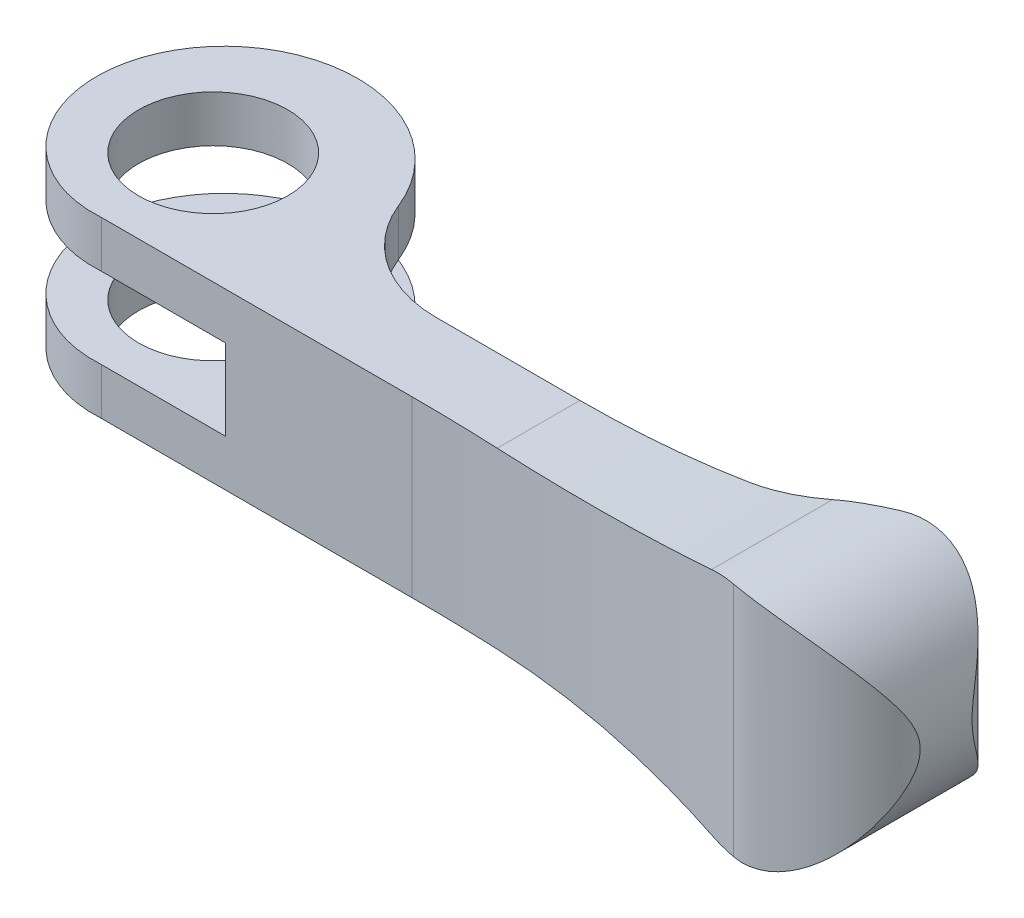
ISO-10303-21;
HEADER;
FILE_DESCRIPTION(('STEP AP214'),'2;1');
FILE_NAME('part.step','',(''),(''),'','','');
FILE_SCHEMA(('AUTOMOTIVE_DESIGN { 1 0 10303 214 1 1 1 1 }'));
ENDSEC;
DATA;
#1=APPLICATION_CONTEXT('core data for automotive mechanical design processes');
#2=APPLICATION_PROTOCOL_DEFINITION('international standard','automotive_design',2000,#1);
#3=PRODUCT_CONTEXT('',#1,'mechanical');
#4=PRODUCT('Part','Part','',(#3));
#5=PRODUCT_RELATED_PRODUCT_CATEGORY('part','',(#4));
#6=PRODUCT_DEFINITION_FORMATION('','',#4);
#7=PRODUCT_DEFINITION_CONTEXT('part definition',#1,'design');
#8=PRODUCT_DEFINITION('design','',#6,#7);
#9=PRODUCT_DEFINITION_SHAPE('','',#8);
#10=(LENGTH_UNIT() NAMED_UNIT(*) SI_UNIT(.MILLI.,.METRE.));
#11=(NAMED_UNIT(*) PLANE_ANGLE_UNIT() SI_UNIT($,.RADIAN.));
#12=(NAMED_UNIT(*) SI_UNIT($,.STERADIAN.) SOLID_ANGLE_UNIT());
#13=UNCERTAINTY_MEASURE_WITH_UNIT(LENGTH_MEASURE(1.E-05),#10,'distance_accuracy_value','');
#14=(GEOMETRIC_REPRESENTATION_CONTEXT(3) GLOBAL_UNCERTAINTY_ASSIGNED_CONTEXT((#13)) GLOBAL_UNIT_ASSIGNED_CONTEXT((#10,
#11,#12)) REPRESENTATION_CONTEXT('',''));
#15=CARTESIAN_POINT('',(0.,0.,0.));
#16=DIRECTION('',(0.,0.,1.));
#17=DIRECTION('',(1.,0.,0.));
#18=AXIS2_PLACEMENT_3D('',#15,#16,#17);
#19=CARTESIAN_POINT('',(25.0000000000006,-9.5,165.511363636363));
#20=DIRECTION('',(0.,1.,0.));
#21=DIRECTION('',(1.,0.,0.));
#22=AXIS2_PLACEMENT_3D('',#19,#20,#21);
#23=CYLINDRICAL_SURFACE('',#22,156.511363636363);
#24=CARTESIAN_POINT('',(51.3201707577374,9.24653148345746,11.2289746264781));
#25=CARTESIAN_POINT('',(51.4954696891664,9.2878649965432,11.2588777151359));
#26=CARTESIAN_POINT('',(51.6718456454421,9.32417702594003,11.2892762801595));
#27=CARTESIAN_POINT('',(52.0256660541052,9.38661054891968,11.3508882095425));
#28=CARTESIAN_POINT('',(52.2031054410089,9.41276355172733,11.3820987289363));
#29=CARTESIAN_POINT('',(52.7374701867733,9.47615348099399,11.4770445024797));
#30=CARTESIAN_POINT('',(53.0960294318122,9.49822441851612,11.5420236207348));
#31=CARTESIAN_POINT('',(53.4546518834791,9.49989176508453,11.6083430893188));
#32=B_SPLINE_CURVE_WITH_KNOTS('',3,(#24,#25,#26,#27,#28,#29,#30,#31),.UNSPECIFIED.,.F.,.F.,(4,2,
2,4),(0.,0.547600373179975,1.09348848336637,2.186546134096),.UNSPECIFIED.);
#33=CARTESIAN_POINT('',(51.3201707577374,9.24653148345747,11.2289746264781));
#34=VERTEX_POINT('',#33);
#35=CARTESIAN_POINT('',(53.4546518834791,9.49989176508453,11.6083430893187));
#36=VERTEX_POINT('',#35);
#37=EDGE_CURVE('E175',#34,#36,#32,.T.);
#38=ORIENTED_EDGE('',*,*,#37,.F.);
#39=CARTESIAN_POINT('',(32.,7.00000000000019,9.1566165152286));
#40=CARTESIAN_POINT('',(32.8182704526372,6.99999719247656,9.19324583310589));
#41=CARTESIAN_POINT('',(33.6361960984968,7.01192923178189,9.23630636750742));
#42=CARTESIAN_POINT('',(35.2705716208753,7.05957160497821,9.33520563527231));
#43=CARTESIAN_POINT('',(36.0870215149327,7.09528165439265,9.39104421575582));
#44=CARTESIAN_POINT('',(38.5259507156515,7.23753055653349,9.57706397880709));
#45=CARTESIAN_POINT('',(40.1451052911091,7.37919060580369,9.7260681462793));
#46=CARTESIAN_POINT('',(43.3672677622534,7.75507082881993,10.073027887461));
#47=CARTESIAN_POINT('',(44.9702760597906,7.98928869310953,10.2709822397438));
#48=CARTESIAN_POINT('',(47.3611114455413,8.40908803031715,10.6035220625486));
#49=CARTESIAN_POINT('',(48.1574841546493,8.56083603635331,10.7205953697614));
#50=CARTESIAN_POINT('',(49.7438041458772,8.88685979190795,10.9662394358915));
#51=CARTESIAN_POINT('',(50.5337515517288,9.061135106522,11.0948099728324));
#52=CARTESIAN_POINT('',(51.3201707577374,9.24653148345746,11.2289746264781));
#53=B_SPLINE_CURVE_WITH_KNOTS('',3,(#39,#40,#41,#42,#43,#44,#45,#46,#47,#48,#49,#50,#51,#52),
.UNSPECIFIED.,.F.,.F.,(4,2,2,2,2,2,4),(0.,2.45704528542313,4.9140611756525,9.8068264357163,
14.6994696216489,17.156439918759,19.6133627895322),.UNSPECIFIED.);
#54=CARTESIAN_POINT('',(32.,7.00000000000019,9.1566165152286));
#55=VERTEX_POINT('',#54);
#56=EDGE_CURVE('E143',#55,#34,#53,.T.);
#57=ORIENTED_EDGE('',*,*,#56,.F.);
#58=CARTESIAN_POINT('',(25.0000000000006,7.,165.511363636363));
#59=DIRECTION('',(0.,1.,0.));
#60=DIRECTION('',(1.,0.,0.));
#61=AXIS2_PLACEMENT_3D('',#58,#59,#60);
#62=CIRCLE('',#61,156.511363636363);
#63=CARTESIAN_POINT('',(25.,7.00000000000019,9.));
#64=VERTEX_POINT('',#63);
#65=EDGE_CURVE('E152',#64,#55,#62,.F.);
#66=ORIENTED_EDGE('',*,*,#65,.F.);
#67=DIRECTION('',(0.,1.,0.));
#68=VECTOR('',#67,1.);
#69=CARTESIAN_POINT('',(25.,-9.5000000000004,9.));
#70=LINE('',#69,#68);
#71=CARTESIAN_POINT('',(25.,-6.9999999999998,9.));
#72=VERTEX_POINT('',#71);
#73=EDGE_CURVE('E300',#72,#64,#70,.T.);
#74=ORIENTED_EDGE('',*,*,#73,.F.);
#75=CARTESIAN_POINT('',(25.0000000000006,-7.,165.511363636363));
#76=DIRECTION('',(0.,1.,0.));
#77=DIRECTION('',(1.,0.,0.));
#78=AXIS2_PLACEMENT_3D('',#75,#76,#77);
#79=CIRCLE('',#78,156.511363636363);
#80=CARTESIAN_POINT('',(32.,-6.9999999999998,9.1566165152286));
#81=VERTEX_POINT('',#80);
#82=EDGE_CURVE('E335',#72,#81,#79,.F.);
#83=ORIENTED_EDGE('',*,*,#82,.T.);
#84=CARTESIAN_POINT('',(32.,-6.9999999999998,9.1566165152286));
#85=CARTESIAN_POINT('',(32.8182704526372,-6.99999719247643,9.19324583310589));
#86=CARTESIAN_POINT('',(33.6361960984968,-7.01192923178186,9.23630636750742));
#87=CARTESIAN_POINT('',(35.2705716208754,-7.05957160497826,9.33520563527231));
#88=CARTESIAN_POINT('',(36.0870215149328,-7.09528165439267,9.39104421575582));
#89=CARTESIAN_POINT('',(38.5259507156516,-7.23753055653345,9.57706397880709));
#90=CARTESIAN_POINT('',(40.1451052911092,-7.37919060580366,9.7260681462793));
#91=CARTESIAN_POINT('',(43.3672677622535,-7.75507082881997,10.073027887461));
#92=CARTESIAN_POINT('',(44.9702760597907,-7.98928869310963,10.2709822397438));
#93=CARTESIAN_POINT('',(47.3611114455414,-8.40908803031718,10.6035220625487));
#94=CARTESIAN_POINT('',(48.1574841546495,-8.56083603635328,10.7205953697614));
#95=CARTESIAN_POINT('',(49.7438041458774,-8.88685979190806,10.9662394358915));
#96=CARTESIAN_POINT('',(50.533751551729,-9.06113510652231,11.0948099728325));
#97=CARTESIAN_POINT('',(51.3201707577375,-9.24653148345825,11.2289746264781));
#98=B_SPLINE_CURVE_WITH_KNOTS('',3,(#84,#85,#86,#87,#88,#89,#90,#91,#92,#93,#94,#95,#96,#97),
.UNSPECIFIED.,.F.,.F.,(4,2,2,2,2,2,4),(0.,2.45704528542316,4.91406117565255,9.80682643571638,
14.6994696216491,17.1564399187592,19.6133627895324),.UNSPECIFIED.);
#99=CARTESIAN_POINT('',(51.3201707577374,-9.24653148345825,11.2289746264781));
#100=VERTEX_POINT('',#99);
#101=EDGE_CURVE('E501',#81,#100,#98,.T.);
#102=ORIENTED_EDGE('',*,*,#101,.T.);
#103=CARTESIAN_POINT('',(51.3201707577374,-9.24653148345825,11.2289746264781));
#104=CARTESIAN_POINT('',(51.4954696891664,-9.28786499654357,11.2588777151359));
#105=CARTESIAN_POINT('',(51.6718456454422,-9.32417702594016,11.2892762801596));
#106=CARTESIAN_POINT('',(52.0256660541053,-9.38661054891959,11.3508882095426));
#107=CARTESIAN_POINT('',(52.203105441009,-9.41276355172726,11.3820987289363));
#108=CARTESIAN_POINT('',(52.7374701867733,-9.47615348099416,11.4770445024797));
#109=CARTESIAN_POINT('',(53.0960294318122,-9.49822441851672,11.5420236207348));
#110=CARTESIAN_POINT('',(53.4546518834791,-9.4998917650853,11.6083430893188));
#111=B_SPLINE_CURVE_WITH_KNOTS('',3,(#103,#104,#105,#106,#107,#108,#109,#110),.UNSPECIFIED.,.F.,
.F.,(4,2,2,4),(0.,0.547600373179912,1.0934884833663,2.18654613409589),.UNSPECIFIED.);
#112=CARTESIAN_POINT('',(53.4546518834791,-9.4998917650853,11.6083430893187));
#113=VERTEX_POINT('',#112);
#114=EDGE_CURVE('E220',#100,#113,#111,.T.);
#115=ORIENTED_EDGE('',*,*,#114,.T.);
#116=DIRECTION('',(0.,1.,0.));
#117=VECTOR('',#116,1.);
#118=CARTESIAN_POINT('',(53.4546518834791,-9.5000000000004,11.6083430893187));
#119=LINE('',#118,#117);
#120=EDGE_CURVE('E283',#113,#36,#119,.T.);
#121=ORIENTED_EDGE('',*,*,#120,.T.);
#122=EDGE_LOOP('',(#38,#57,#66,#74,#83,#102,#115,#121));
#123=FACE_BOUND('',#122,.T.);
#124=ADVANCED_FACE('F14',(#123),#23,.F.);
#125=CARTESIAN_POINT('',(0.,-9.5000000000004,9.));
#126=DIRECTION('',(0.,0.,-1.));
#127=DIRECTION('',(1.,0.,0.));
#128=AXIS2_PLACEMENT_3D('',#125,#126,#127);
#129=PLANE('',#128);
#130=DIRECTION('',(1.,0.,0.));
#131=VECTOR('',#130,1.);
#132=CARTESIAN_POINT('',(0.,7.00000000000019,9.));
#133=LINE('',#132,#131);
#134=CARTESIAN_POINT('',(0.,7.00000000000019,9.));
#135=VERTEX_POINT('',#134);
#136=EDGE_CURVE('E163',#135,#64,#133,.T.);
#137=ORIENTED_EDGE('',*,*,#136,.F.);
#138=DIRECTION('',(0.,1.,0.));
#139=VECTOR('',#138,1.);
#140=CARTESIAN_POINT('',(0.,-9.5000000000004,9.));
#141=LINE('',#140,#139);
#142=CARTESIAN_POINT('',(0.,3.25,9.));
#143=VERTEX_POINT('',#142);
#144=EDGE_CURVE('E291',#143,#135,#141,.T.);
#145=ORIENTED_EDGE('',*,*,#144,.F.);
#146=DIRECTION('',(1.,0.,0.));
#147=VECTOR('',#146,1.);
#148=CARTESIAN_POINT('',(0.,3.25,9.));
#149=LINE('',#148,#147);
#150=CARTESIAN_POINT('',(10.,3.25,9.));
#151=VERTEX_POINT('',#150);
#152=EDGE_CURVE('E345',#143,#151,#149,.T.);
#153=ORIENTED_EDGE('',*,*,#152,.T.);
#154=DIRECTION('',(0.,-1.,0.));
#155=VECTOR('',#154,1.);
#156=CARTESIAN_POINT('',(10.,-9.5000000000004,9.));
#157=LINE('',#156,#155);
#158=CARTESIAN_POINT('',(10.,-3.25,9.));
#159=VERTEX_POINT('',#158);
#160=EDGE_CURVE('E359',#151,#159,#157,.T.);
#161=ORIENTED_EDGE('',*,*,#160,.T.);
#162=DIRECTION('',(-1.,0.,0.));
#163=VECTOR('',#162,1.);
#164=CARTESIAN_POINT('',(0.,-3.25,9.));
#165=LINE('',#164,#163);
#166=CARTESIAN_POINT('',(0.,-3.25,9.));
#167=VERTEX_POINT('',#166);
#168=EDGE_CURVE('E354',#159,#167,#165,.T.);
#169=ORIENTED_EDGE('',*,*,#168,.T.);
#170=CARTESIAN_POINT('',(0.,-6.9999999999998,9.));
#171=VERTEX_POINT('',#170);
#172=EDGE_CURVE('E294',#171,#167,#141,.T.);
#173=ORIENTED_EDGE('',*,*,#172,.F.);
#174=DIRECTION('',(1.,0.,0.));
#175=VECTOR('',#174,1.);
#176=CARTESIAN_POINT('',(0.,-6.9999999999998,9.));
#177=LINE('',#176,#175);
#178=EDGE_CURVE('E502',#171,#72,#177,.T.);
#179=ORIENTED_EDGE('',*,*,#178,.T.);
#180=ORIENTED_EDGE('',*,*,#73,.T.);
#181=EDGE_LOOP('',(#137,#145,#153,#161,#169,#173,#179,#180));
#182=FACE_BOUND('',#181,.T.);
#183=ADVANCED_FACE('F271',(#182),#129,.F.);
#184=CARTESIAN_POINT('',(0.,-9.5000000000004,9.));
#185=CARTESIAN_POINT('',(-1.17809724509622,-9.5000000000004,9.082375));
#186=CARTESIAN_POINT('',(-2.38889185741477,-9.5000000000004,8.9303425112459));
#187=CARTESIAN_POINT('',(-4.68855121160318,-9.5000000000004,8.15611653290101));
#188=CARTESIAN_POINT('',(-5.77641227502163,-9.5000000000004,7.53398899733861));
#189=CARTESIAN_POINT('',(-7.650484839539,-9.5,5.89290811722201));
#190=CARTESIAN_POINT('',(-8.43577630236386,-9.5,4.87441779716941));
#191=CARTESIAN_POINT('',(-9.56393765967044,-9.5,2.58130784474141));
#192=CARTESIAN_POINT('',(-9.90612499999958,-9.5,1.3074915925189));
#193=CARTESIAN_POINT('',(-10.070875,-9.5,-1.307491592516));
#194=CARTESIAN_POINT('',(-9.8931145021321,-9.5,-2.64762964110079));
#195=CARTESIAN_POINT('',(-9.01985437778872,-9.5,-5.1863785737));
#196=CARTESIAN_POINT('',(-8.32445967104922,-9.5,-6.3838917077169));
#197=CARTESIAN_POINT('',(-6.50038754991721,-9.5,-8.4409555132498));
#198=CARTESIAN_POINT('',(-5.37224515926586,-9.5,-9.29951414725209));
#199=CARTESIAN_POINT('',(-2.84004562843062,-9.5,-10.5267096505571));
#200=CARTESIAN_POINT('',(-1.43688593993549,-9.5,-10.894625));
#201=CARTESIAN_POINT('',(1.43688593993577,-9.5,-11.059375));
#202=CARTESIAN_POINT('',(2.90636742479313,-9.5,-10.8558864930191));
#203=CARTESIAN_POINT('',(5.68420593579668,-9.5,-9.8835922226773));
#204=CARTESIAN_POINT('',(6.99137114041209,-9.5,-9.1149303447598));
#205=CARTESIAN_POINT('',(9.23142618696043,-9.5,-7.1078669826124));
#206=CARTESIAN_POINT('',(10.1632519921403,-9.5,-5.8700725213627));
#207=CARTESIAN_POINT('',(11.4894816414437,-9.5,-3.09878341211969));
#208=CARTESIAN_POINT('',(11.883125,-9.5,-1.5662802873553));
#209=CARTESIAN_POINT('',(12.047875,-9.5,1.5662802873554));
#210=CARTESIAN_POINT('',(11.8186584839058,-9.5,3.16510520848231));
#211=CARTESIAN_POINT('',(10.7473300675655,-9.5,6.18203329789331));
#212=CARTESIAN_POINT('',(9.90540101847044,-9.5000000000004,7.5988505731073));
#213=CARTESIAN_POINT('',(7.71534641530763,-9.5000000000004,10.021896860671));
#214=CARTESIAN_POINT('',(6.36789988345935,-9.5000000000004,11.0269898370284));
#215=CARTESIAN_POINT('',(3.35752119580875,-9.5000000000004,12.4522536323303));
#216=CARTESIAN_POINT('',(1.69567463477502,-9.5000000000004,12.871625));
#217=CARTESIAN_POINT('',(0.,-9.5000000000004,12.954));
#218=B_SPLINE_CURVE_WITH_KNOTS('',3,(#184,#185,#186,#187,#188,#189,#190,#191,#192,#193,#194,
#195,#196,#197,#198,#199,#200,#201,#202,#203,#204,#205,#206,#207,#208,#209,#210,#211,#212,#213,
#214,#215,#216,#217),.UNSPECIFIED.,.F.,.F.,(4,2,2,2,2,2,2,2,2,2,2,2,2,2,2,2,4),(0.,0.0625,0.125,
0.1875,0.25,0.3125,0.375,0.4375,0.5,0.5625,0.625,0.6875,0.75,0.8125,0.875,0.9375,1.),.UNSPECIFIED.);
#219=DIRECTION('',(0.,1.,0.));
#220=VECTOR('',#219,1.);
#221=SURFACE_OF_LINEAR_EXTRUSION('',#218,#220);
#222=CARTESIAN_POINT('',(0.,7.00000000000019,9.));
#223=CARTESIAN_POINT('',(-1.17809724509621,7.00000000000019,9.082375));
#224=CARTESIAN_POINT('',(-2.38889185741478,7.00000000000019,8.9303425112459));
#225=CARTESIAN_POINT('',(-4.68855121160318,7.0000000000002,8.15611653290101));
#226=CARTESIAN_POINT('',(-5.77641227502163,7.0000000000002,7.53398899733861));
#227=CARTESIAN_POINT('',(-7.650484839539,7.,5.89290811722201));
#228=CARTESIAN_POINT('',(-8.43577630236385,7.,4.87441779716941));
#229=CARTESIAN_POINT('',(-9.56393765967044,7.,2.58130784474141));
#230=CARTESIAN_POINT('',(-9.90612499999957,7.,1.30749159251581));
#231=CARTESIAN_POINT('',(-10.070875,7.,-1.307491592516));
#232=CARTESIAN_POINT('',(-9.89311450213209,7.0000000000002,-2.6476296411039));
#233=CARTESIAN_POINT('',(-9.01985437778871,7.0000000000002,-5.1863785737));
#234=CARTESIAN_POINT('',(-8.32445967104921,7.0000000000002,-6.3838917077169));
#235=CARTESIAN_POINT('',(-6.50038754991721,7.,-8.4409555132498));
#236=CARTESIAN_POINT('',(-5.37224515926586,7.,-9.29951414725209));
#237=CARTESIAN_POINT('',(-2.84004562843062,7.,-10.5267096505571));
#238=CARTESIAN_POINT('',(-1.43688593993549,7.,-10.894625));
#239=CARTESIAN_POINT('',(1.43688593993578,7.,-11.059375));
#240=CARTESIAN_POINT('',(2.90636742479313,7.,-10.8558864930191));
#241=CARTESIAN_POINT('',(5.68420593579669,7.,-9.8835922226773));
#242=CARTESIAN_POINT('',(6.99137114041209,7.,-9.1149303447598));
#243=CARTESIAN_POINT('',(9.23142618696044,7.00000000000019,-7.1078669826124));
#244=CARTESIAN_POINT('',(10.1632519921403,7.00000000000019,-5.8700725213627));
#245=CARTESIAN_POINT('',(11.4894816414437,7.00000000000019,-3.09878341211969));
#246=CARTESIAN_POINT('',(11.883125,7.00000000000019,-1.5662802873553));
#247=CARTESIAN_POINT('',(12.047875,7.,1.5662802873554));
#248=CARTESIAN_POINT('',(11.8186584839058,7.,3.16510520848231));
#249=CARTESIAN_POINT('',(10.7473300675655,7.,6.18203329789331));
#250=CARTESIAN_POINT('',(9.90540101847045,7.00000000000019,7.5988505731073));
#251=CARTESIAN_POINT('',(7.71534641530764,7.00000000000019,10.021896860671));
#252=CARTESIAN_POINT('',(6.36789988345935,7.00000000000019,11.0269898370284));
#253=CARTESIAN_POINT('',(3.35752119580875,7.00000000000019,12.4522536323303));
#254=CARTESIAN_POINT('',(1.69567463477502,7.00000000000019,12.871625));
#255=CARTESIAN_POINT('',(0.,7.00000000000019,12.954));
#256=B_SPLINE_CURVE_WITH_KNOTS('',3,(#222,#223,#224,#225,#226,#227,#228,#229,#230,#231,#232,
#233,#234,#235,#236,#237,#238,#239,#240,#241,#242,#243,#244,#245,#246,#247,#248,#249,#250,#251,
#252,#253,#254,#255),.UNSPECIFIED.,.F.,.F.,(4,2,2,2,2,2,2,2,2,2,2,2,2,2,2,2,4),(0.,0.0625,0.125,
0.1875,0.25,0.3125,0.375,0.4375,0.5,0.5625,0.625,0.6875,0.75,0.8125,0.875,0.9375,1.),.UNSPECIFIED.);
#257=CARTESIAN_POINT('',(11.1333903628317,7.00000000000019,-3.78460278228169));
#258=VERTEX_POINT('',#257);
#259=EDGE_CURVE('E161',#258,#135,#256,.F.);
#260=ORIENTED_EDGE('',*,*,#259,.F.);
#261=DIRECTION('',(0.,1.,0.));
#262=VECTOR('',#261,1.);
#263=CARTESIAN_POINT('',(11.1333903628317,9.5,-3.78460278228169));
#264=LINE('',#263,#262);
#265=CARTESIAN_POINT('',(11.1333903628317,3.2499999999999,-3.78460278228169));
#266=VERTEX_POINT('',#265);
#267=EDGE_CURVE('E35',#258,#266,#264,.F.);
#268=ORIENTED_EDGE('',*,*,#267,.T.);
#269=CARTESIAN_POINT('',(0.,3.25,9.));
#270=CARTESIAN_POINT('',(-1.17809724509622,3.25,9.082375));
#271=CARTESIAN_POINT('',(-2.38889185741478,3.25,8.9303425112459));
#272=CARTESIAN_POINT('',(-4.68855121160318,3.25,8.15611653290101));
#273=CARTESIAN_POINT('',(-5.77641227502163,3.25,7.53398899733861));
#274=CARTESIAN_POINT('',(-7.650484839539,3.25,5.89290811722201));
#275=CARTESIAN_POINT('',(-8.43577630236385,3.25,4.87441779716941));
#276=CARTESIAN_POINT('',(-9.56393765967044,3.2499999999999,2.58130784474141));
#277=CARTESIAN_POINT('',(-9.90612499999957,3.25,1.30749159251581));
#278=CARTESIAN_POINT('',(-10.070875,3.25,-1.307491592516));
#279=CARTESIAN_POINT('',(-9.89311450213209,3.25,-2.6476296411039));
#280=CARTESIAN_POINT('',(-9.01985437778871,3.25,-5.1863785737));
#281=CARTESIAN_POINT('',(-8.32445967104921,3.25,-6.3838917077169));
#282=CARTESIAN_POINT('',(-6.50038754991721,3.25,-8.4409555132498));
#283=CARTESIAN_POINT('',(-5.37224515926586,3.25,-9.29951414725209));
#284=CARTESIAN_POINT('',(-2.84004562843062,3.25,-10.5267096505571));
#285=CARTESIAN_POINT('',(-1.43688593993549,3.25,-10.894625));
#286=CARTESIAN_POINT('',(1.43688593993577,3.25,-11.059375));
#287=CARTESIAN_POINT('',(2.90636742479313,3.25,-10.8558864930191));
#288=CARTESIAN_POINT('',(5.68420593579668,3.25,-9.8835922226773));
#289=CARTESIAN_POINT('',(6.99137114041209,3.25,-9.1149303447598));
#290=CARTESIAN_POINT('',(9.23142618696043,3.25,-7.1078669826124));
#291=CARTESIAN_POINT('',(10.1632519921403,3.25,-5.8700725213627));
#292=CARTESIAN_POINT('',(11.4894816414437,3.25,-3.09878341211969));
#293=CARTESIAN_POINT('',(11.883125,3.25,-1.5662802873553));
#294=CARTESIAN_POINT('',(12.047875,3.25,1.5662802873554));
#295=CARTESIAN_POINT('',(11.8186584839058,3.2499999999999,3.16510520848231));
#296=CARTESIAN_POINT('',(10.7473300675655,3.25,6.18203329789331));
#297=CARTESIAN_POINT('',(9.90540101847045,3.25,7.5988505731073));
#298=CARTESIAN_POINT('',(7.71534641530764,3.2499999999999,10.021896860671));
#299=CARTESIAN_POINT('',(6.36789988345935,3.2499999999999,11.0269898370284));
#300=CARTESIAN_POINT('',(3.35752119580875,3.25,12.4522536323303));
#301=CARTESIAN_POINT('',(1.69567463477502,3.25,12.871625));
#302=CARTESIAN_POINT('',(0.,3.25,12.954));
#303=B_SPLINE_CURVE_WITH_KNOTS('',3,(#269,#270,#271,#272,#273,#274,#275,#276,#277,#278,#279,
#280,#281,#282,#283,#284,#285,#286,#287,#288,#289,#290,#291,#292,#293,#294,#295,#296,#297,#298,
#299,#300,#301,#302),.UNSPECIFIED.,.F.,.F.,(4,2,2,2,2,2,2,2,2,2,2,2,2,2,2,2,4),(0.,0.0625,0.125,
0.1875,0.25,0.3125,0.375,0.4375,0.5,0.5625,0.625,0.6875,0.75,0.8125,0.875,0.9375,1.),.UNSPECIFIED.);
#304=EDGE_CURVE('E39',#266,#143,#303,.F.);
#305=ORIENTED_EDGE('',*,*,#304,.T.);
#306=ORIENTED_EDGE('',*,*,#144,.T.);
#307=EDGE_LOOP('',(#260,#268,#305,#306));
#308=FACE_BOUND('',#307,.T.);
#309=ADVANCED_FACE('F277',(#308),#221,.F.);
#310=CARTESIAN_POINT('',(11.8345872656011,-9.5,2.5));
#311=DIRECTION('',(0.,0.,1.));
#312=DIRECTION('',(-1.,0.,0.));
#313=AXIS2_PLACEMENT_3D('',#310,#311,#312);
#314=PLANE('',#313);
#315=CARTESIAN_POINT('',(32.,91.2,2.5));
#316=DIRECTION('',(0.,0.,1.));
#317=DIRECTION('',(-1.,0.,0.));
#318=AXIS2_PLACEMENT_3D('',#315,#316,#317);
#319=CIRCLE('',#318,84.2);
#320=CARTESIAN_POINT('',(45.5626570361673,8.099492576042,2.5));
#321=VERTEX_POINT('',#320);
#322=CARTESIAN_POINT('',(32.,7.,2.5));
#323=VERTEX_POINT('',#322);
#324=EDGE_CURVE('E132',#321,#323,#319,.F.);
#325=ORIENTED_EDGE('',*,*,#324,.F.);
#326=DIRECTION('',(0.,1.,0.));
#327=VECTOR('',#326,1.);
#328=CARTESIAN_POINT('',(45.5626570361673,-9.5,2.5));
#329=LINE('',#328,#327);
#330=CARTESIAN_POINT('',(45.5626570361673,-8.099492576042,2.5));
#331=VERTEX_POINT('',#330);
#332=EDGE_CURVE('E287',#331,#321,#329,.T.);
#333=ORIENTED_EDGE('',*,*,#332,.F.);
#334=CARTESIAN_POINT('',(32.,-91.2,2.5));
#335=DIRECTION('',(0.,0.,1.));
#336=DIRECTION('',(-1.,0.,0.));
#337=AXIS2_PLACEMENT_3D('',#334,#335,#336);
#338=CIRCLE('',#337,84.2);
#339=CARTESIAN_POINT('',(32.,-7.,2.5));
#340=VERTEX_POINT('',#339);
#341=EDGE_CURVE('E255',#331,#340,#338,.T.);
#342=ORIENTED_EDGE('',*,*,#341,.T.);
#343=DIRECTION('',(-1.,0.,0.));
#344=VECTOR('',#343,1.);
#345=CARTESIAN_POINT('',(11.8345872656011,-7.,2.5));
#346=LINE('',#345,#344);
#347=CARTESIAN_POINT('',(20.417560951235,-7.,2.5));
#348=VERTEX_POINT('',#347);
#349=EDGE_CURVE('E318',#340,#348,#346,.T.);
#350=ORIENTED_EDGE('',*,*,#349,.T.);
#351=DIRECTION('',(0.,-1.,0.));
#352=VECTOR('',#351,1.);
#353=CARTESIAN_POINT('',(20.417560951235,9.5,2.5));
#354=LINE('',#353,#352);
#355=CARTESIAN_POINT('',(20.417560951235,-3.25,2.5));
#356=VERTEX_POINT('',#355);
#357=EDGE_CURVE('E303',#348,#356,#354,.F.);
#358=ORIENTED_EDGE('',*,*,#357,.T.);
#359=DIRECTION('',(-1.,0.,0.));
#360=VECTOR('',#359,1.);
#361=CARTESIAN_POINT('',(28.,-3.25,2.5));
#362=LINE('',#361,#360);
#363=CARTESIAN_POINT('',(10.,-3.25,2.5));
#364=VERTEX_POINT('',#363);
#365=EDGE_CURVE('E331',#356,#364,#362,.T.);
#366=ORIENTED_EDGE('',*,*,#365,.T.);
#367=DIRECTION('',(0.,1.,0.));
#368=VECTOR('',#367,1.);
#369=CARTESIAN_POINT('',(10.,-3.25,2.5));
#370=LINE('',#369,#368);
#371=CARTESIAN_POINT('',(10.,3.25,2.5));
#372=VERTEX_POINT('',#371);
#373=EDGE_CURVE('E329',#364,#372,#370,.T.);
#374=ORIENTED_EDGE('',*,*,#373,.T.);
#375=DIRECTION('',(-1.,0.,0.));
#376=VECTOR('',#375,1.);
#377=CARTESIAN_POINT('',(28.,3.25,2.5));
#378=LINE('',#377,#376);
#379=CARTESIAN_POINT('',(20.417560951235,3.25,2.5));
#380=VERTEX_POINT('',#379);
#381=EDGE_CURVE('E326',#380,#372,#378,.T.);
#382=ORIENTED_EDGE('',*,*,#381,.F.);
#383=CARTESIAN_POINT('',(20.417560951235,7.,2.5));
#384=VERTEX_POINT('',#383);
#385=EDGE_CURVE('E160',#380,#384,#354,.F.);
#386=ORIENTED_EDGE('',*,*,#385,.T.);
#387=DIRECTION('',(-1.,0.,0.));
#388=VECTOR('',#387,1.);
#389=CARTESIAN_POINT('',(11.8345872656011,7.,2.5));
#390=LINE('',#389,#388);
#391=EDGE_CURVE('E149',#323,#384,#390,.T.);
#392=ORIENTED_EDGE('',*,*,#391,.F.);
#393=EDGE_LOOP('',(#325,#333,#342,#350,#358,#366,#374,#382,#386,#392));
#394=FACE_BOUND('',#393,.T.);
#395=ADVANCED_FACE('F157',(#394),#314,.F.);
#396=CARTESIAN_POINT('',(45.5626570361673,-9.5,-14.5));
#397=DIRECTION('',(0.,1.,0.));
#398=DIRECTION('',(1.,0.,0.));
#399=AXIS2_PLACEMENT_3D('',#396,#397,#398);
#400=CYLINDRICAL_SURFACE('',#399,17.);
#401=CARTESIAN_POINT('',(54.9597606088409,9.38717736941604,-0.333333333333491));
#402=CARTESIAN_POINT('',(54.7316206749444,9.42267662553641,-0.181950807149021));
#403=CARTESIAN_POINT('',(54.498837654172,9.45033434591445,-0.0355271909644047));
#404=CARTESIAN_POINT('',(54.0250539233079,9.48845532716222,0.246646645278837));
#405=CARTESIAN_POINT('',(53.7840411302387,9.4988920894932,0.382380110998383));
#406=CARTESIAN_POINT('',(53.3000815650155,9.50092219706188,0.639552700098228));
#407=CARTESIAN_POINT('',(53.0572524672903,9.49285956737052,0.761209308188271));
#408=CARTESIAN_POINT('',(52.5674007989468,9.45729667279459,0.992150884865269));
#409=CARTESIAN_POINT('',(52.3203826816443,9.42981592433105,1.10144814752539));
#410=CARTESIAN_POINT('',(51.9475951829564,9.37315159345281,1.25597755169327));
#411=CARTESIAN_POINT('',(51.8226148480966,9.35161024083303,1.30604046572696));
#412=CARTESIAN_POINT('',(51.5718111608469,9.30314348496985,1.40308902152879));
#413=CARTESIAN_POINT('',(51.4459865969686,9.27619341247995,1.4500592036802));
#414=CARTESIAN_POINT('',(51.3201707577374,9.24653148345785,1.4953441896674));
#415=B_SPLINE_CURVE_WITH_KNOTS('',3,(#401,#402,#403,#404,#405,#406,#407,#408,#409,#410,#411,
#412,#413,#414),.UNSPECIFIED.,.F.,.F.,(4,2,2,2,2,2,4),(0.,0.828239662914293,1.65775258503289,
2.47196473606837,3.28535971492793,3.69427519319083,4.10509995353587),.UNSPECIFIED.);
#416=CARTESIAN_POINT('',(54.9597606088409,9.38717736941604,-0.333333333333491));
#417=VERTEX_POINT('',#416);
#418=CARTESIAN_POINT('',(51.3201707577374,9.24653148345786,1.4953441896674));
#419=VERTEX_POINT('',#418);
#420=EDGE_CURVE('E144',#417,#419,#415,.T.);
#421=ORIENTED_EDGE('',*,*,#420,.F.);
#422=DIRECTION('',(0.,1.,0.));
#423=VECTOR('',#422,1.);
#424=CARTESIAN_POINT('',(54.9597606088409,-9.5,-0.333333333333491));
#425=LINE('',#424,#423);
#426=CARTESIAN_POINT('',(54.9597606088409,-9.38717736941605,-0.333333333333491));
#427=VERTEX_POINT('',#426);
#428=EDGE_CURVE('E292',#427,#417,#425,.T.);
#429=ORIENTED_EDGE('',*,*,#428,.F.);
#430=CARTESIAN_POINT('',(54.9597606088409,-9.38717736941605,-0.333333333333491));
#431=CARTESIAN_POINT('',(54.7316206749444,-9.42267662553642,-0.181950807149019));
#432=CARTESIAN_POINT('',(54.498837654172,-9.45033434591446,-0.0355271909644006));
#433=CARTESIAN_POINT('',(54.0250539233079,-9.48845532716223,0.246646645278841));
#434=CARTESIAN_POINT('',(53.7840411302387,-9.4988920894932,0.382380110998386));
#435=CARTESIAN_POINT('',(53.3000815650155,-9.50092219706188,0.63955270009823));
#436=CARTESIAN_POINT('',(53.0572524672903,-9.49285956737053,0.761209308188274));
#437=CARTESIAN_POINT('',(52.5674007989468,-9.45729667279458,0.992150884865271));
#438=CARTESIAN_POINT('',(52.3203826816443,-9.42981592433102,1.1014481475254));
#439=CARTESIAN_POINT('',(51.9475951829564,-9.37315159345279,1.25597755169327));
#440=CARTESIAN_POINT('',(51.8226148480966,-9.35161024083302,1.30604046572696));
#441=CARTESIAN_POINT('',(51.5718111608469,-9.30314348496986,1.40308902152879));
#442=CARTESIAN_POINT('',(51.4459865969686,-9.27619341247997,1.4500592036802));
#443=CARTESIAN_POINT('',(51.3201707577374,-9.24653148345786,1.4953441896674));
#444=B_SPLINE_CURVE_WITH_KNOTS('',3,(#430,#431,#432,#433,#434,#435,#436,#437,#438,#439,#440,
#441,#442,#443),.UNSPECIFIED.,.F.,.F.,(4,2,2,2,2,2,4),(0.,0.828239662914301,1.65775258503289,
2.47196473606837,3.28535971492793,3.69427519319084,4.10509995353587),.UNSPECIFIED.);
#445=CARTESIAN_POINT('',(51.3201707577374,-9.24653148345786,1.4953441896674));
#446=VERTEX_POINT('',#445);
#447=EDGE_CURVE('E221',#427,#446,#444,.T.);
#448=ORIENTED_EDGE('',*,*,#447,.T.);
#449=CARTESIAN_POINT('',(51.3201707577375,-9.24653148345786,1.4953441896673));
#450=CARTESIAN_POINT('',(50.8603357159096,-9.13808848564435,1.66090351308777));
#451=CARTESIAN_POINT('',(50.3928479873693,-9.03200341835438,1.80673339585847));
#452=CARTESIAN_POINT('',(49.4492987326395,-8.82651076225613,2.05687636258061));
#453=CARTESIAN_POINT('',(48.9733251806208,-8.72705992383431,2.16148595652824));
#454=CARTESIAN_POINT('',(48.0126814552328,-8.53516921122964,2.32959170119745));
#455=CARTESIAN_POINT('',(47.5280109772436,-8.44272958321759,2.39308640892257));
#456=CARTESIAN_POINT('',(46.7955018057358,-8.30973871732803,2.45702873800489));
#457=CARTESIAN_POINT('',(46.5494786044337,-8.26620019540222,2.4731270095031));
#458=CARTESIAN_POINT('',(46.0565939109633,-8.18123846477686,2.49461289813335));
#459=CARTESIAN_POINT('',(45.8097323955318,-8.13981531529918,2.50000021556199));
#460=CARTESIAN_POINT('',(45.5626570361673,-8.099492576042,2.5));
#461=B_SPLINE_CURVE_WITH_KNOTS('',3,(#449,#450,#451,#452,#453,#454,#455,#456,#457,#458,#459,
#460),.UNSPECIFIED.,.F.,.F.,(4,2,2,2,2,4),(0.,1.50137798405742,2.99174983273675,
4.48217398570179,5.23305850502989,5.98396403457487),.UNSPECIFIED.);
#462=EDGE_CURVE('E289',#446,#331,#461,.T.);
#463=ORIENTED_EDGE('',*,*,#462,.T.);
#464=ORIENTED_EDGE('',*,*,#332,.T.);
#465=CARTESIAN_POINT('',(51.3201707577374,9.24653148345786,1.4953441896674));
#466=CARTESIAN_POINT('',(50.8603357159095,9.13808848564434,1.66090351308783));
#467=CARTESIAN_POINT('',(50.3928479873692,9.03200341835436,1.8067333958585));
#468=CARTESIAN_POINT('',(49.4492987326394,8.8265107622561,2.05687636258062));
#469=CARTESIAN_POINT('',(48.9733251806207,8.72705992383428,2.16148595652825));
#470=CARTESIAN_POINT('',(48.0126814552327,8.53516921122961,2.32959170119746));
#471=CARTESIAN_POINT('',(47.5280109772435,8.44272958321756,2.39308640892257));
#472=CARTESIAN_POINT('',(46.7955018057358,8.30973871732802,2.45702873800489));
#473=CARTESIAN_POINT('',(46.5494786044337,8.26620019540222,2.4731270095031));
#474=CARTESIAN_POINT('',(46.0565939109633,8.18123846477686,2.49461289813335));
#475=CARTESIAN_POINT('',(45.8097323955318,8.13981531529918,2.50000021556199));
#476=CARTESIAN_POINT('',(45.5626570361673,8.099492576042,2.5));
#477=B_SPLINE_CURVE_WITH_KNOTS('',3,(#465,#466,#467,#468,#469,#470,#471,#472,#473,#474,#475,
#476),.UNSPECIFIED.,.F.,.F.,(4,2,2,2,2,4),(0.,1.50137798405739,2.99174983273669,
4.48217398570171,5.23305850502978,5.98396403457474),.UNSPECIFIED.);
#478=EDGE_CURVE('E9',#419,#321,#477,.T.);
#479=ORIENTED_EDGE('',*,*,#478,.F.);
#480=EDGE_LOOP('',(#421,#429,#448,#463,#464,#479));
#481=FACE_BOUND('',#480,.T.);
#482=ADVANCED_FACE('F186',(#481),#400,.F.);
#483=CARTESIAN_POINT('',(58.,-9.5,4.25));
#484=DIRECTION('',(0.,1.,0.));
#485=DIRECTION('',(1.,0.,0.));
#486=AXIS2_PLACEMENT_3D('',#483,#484,#485);
#487=CYLINDRICAL_SURFACE('',#486,5.5);
#488=ORIENTED_EDGE('',*,*,#428,.T.);
#489=CARTESIAN_POINT('',(54.9597606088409,9.38717736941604,-0.333333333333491));
#490=CARTESIAN_POINT('',(55.0773672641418,9.36890920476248,-0.411379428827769));
#491=CARTESIAN_POINT('',(55.1977181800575,9.34791104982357,-0.484658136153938));
#492=CARTESIAN_POINT('',(55.4427584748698,9.30006282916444,-0.621356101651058));
#493=CARTESIAN_POINT('',(55.567447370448,9.27321341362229,-0.684776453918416));
#494=CARTESIAN_POINT('',(55.8194893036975,9.21339759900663,-0.801196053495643));
#495=CARTESIAN_POINT('',(55.9468283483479,9.1804583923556,-0.854239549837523));
#496=CARTESIAN_POINT('',(56.2035022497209,9.10817454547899,-0.950130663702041));
#497=CARTESIAN_POINT('',(56.3328370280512,9.0688301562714,-0.992978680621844));
#498=CARTESIAN_POINT('',(56.5923414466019,8.98365610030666,-1.06853033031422));
#499=CARTESIAN_POINT('',(56.7225111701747,8.93782577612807,-1.10123293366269));
#500=CARTESIAN_POINT('',(56.9825914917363,8.83973306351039,-1.1567151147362));
#501=CARTESIAN_POINT('',(57.1125019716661,8.78746822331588,-1.17949089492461));
#502=CARTESIAN_POINT('',(57.3709755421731,8.67671123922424,-1.21546938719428));
#503=CARTESIAN_POINT('',(57.49953864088,8.61821913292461,-1.2286721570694));
#504=CARTESIAN_POINT('',(57.7544514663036,8.49527400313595,-1.24600183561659));
#505=CARTESIAN_POINT('',(57.8808003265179,8.430818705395,-1.25012526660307));
#506=CARTESIAN_POINT('',(58.1354029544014,8.29365764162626,-1.24986389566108));
#507=CARTESIAN_POINT('',(58.2635348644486,8.22072656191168,-1.24513662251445));
#508=CARTESIAN_POINT('',(58.5158521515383,8.06925777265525,-1.22721754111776));
#509=CARTESIAN_POINT('',(58.6400360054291,7.99071793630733,-1.21402250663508));
#510=CARTESIAN_POINT('',(59.005866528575,7.7473260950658,-1.16283883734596));
#511=CARTESIAN_POINT('',(59.2408364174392,7.57467783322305,-1.11325109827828));
#512=CARTESIAN_POINT('',(59.640504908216,7.25224475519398,-1.00279535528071));
#513=CARTESIAN_POINT('',(59.8093120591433,7.10575174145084,-0.946787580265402));
#514=CARTESIAN_POINT('',(60.1338203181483,6.80378902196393,-0.82218057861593));
#515=CARTESIAN_POINT('',(60.2895153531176,6.64831521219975,-0.753575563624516));
#516=CARTESIAN_POINT('',(60.737174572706,6.16963779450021,-0.532140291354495));
#517=CARTESIAN_POINT('',(61.0091468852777,5.83464136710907,-0.363861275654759));
#518=CARTESIAN_POINT('',(61.4235163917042,5.24914542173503,-0.0596940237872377));
#519=CARTESIAN_POINT('',(61.5798678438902,5.00488750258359,0.0699222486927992));
#520=CARTESIAN_POINT('',(61.8685709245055,4.50557316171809,0.335588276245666));
#521=CARTESIAN_POINT('',(62.0009048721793,4.25050895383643,0.471642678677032));
#522=CARTESIAN_POINT('',(62.2419737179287,3.72966259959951,0.74447425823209));
#523=CARTESIAN_POINT('',(62.3506994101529,3.46387631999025,0.881251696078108));
#524=CARTESIAN_POINT('',(62.4960478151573,3.05644242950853,1.08102942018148));
#525=CARTESIAN_POINT('',(62.5415283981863,2.91921920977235,1.14670294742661));
#526=CARTESIAN_POINT('',(62.626527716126,2.64151248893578,1.27491345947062));
#527=CARTESIAN_POINT('',(62.6660477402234,2.50102970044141,1.33745112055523));
#528=CARTESIAN_POINT('',(62.7372492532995,2.22323842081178,1.45483334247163));
#529=CARTESIAN_POINT('',(62.7692149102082,2.08609863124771,1.50990265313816));
#530=CARTESIAN_POINT('',(62.8273897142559,1.8082943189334,1.61374359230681));
#531=CARTESIAN_POINT('',(62.8536014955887,1.66763144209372,1.66251809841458));
#532=CARTESIAN_POINT('',(62.8998518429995,1.38326816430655,1.75121136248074));
#533=CARTESIAN_POINT('',(62.9199198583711,1.23958589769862,1.79117210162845));
#534=CARTESIAN_POINT('',(62.95362517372,0.948860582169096,1.8597961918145));
#535=CARTESIAN_POINT('',(62.9672684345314,0.801820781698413,1.88847001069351));
#536=CARTESIAN_POINT('',(62.984943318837,0.545508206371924,1.9260711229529));
#537=CARTESIAN_POINT('',(62.990578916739,0.436822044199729,1.93824615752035));
#538=CARTESIAN_POINT('',(62.9981073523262,0.218764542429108,1.9545696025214));
#539=CARTESIAN_POINT('',(63.0000019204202,0.109393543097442,1.95872172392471));
#540=CARTESIAN_POINT('',(62.9999971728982,-0.161040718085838,1.95869806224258));
#541=CARTESIAN_POINT('',(62.9958843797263,-0.322130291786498,1.94966497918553));
#542=CARTESIAN_POINT('',(62.979631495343,-0.642129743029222,1.91470313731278));
#543=CARTESIAN_POINT('',(62.9674826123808,-0.801037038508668,1.88875587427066));
#544=CARTESIAN_POINT('',(62.9355349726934,-1.11623389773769,1.82269084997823));
#545=CARTESIAN_POINT('',(62.9156805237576,-1.272495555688,1.78247011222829));
#546=CARTESIAN_POINT('',(62.8688685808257,-1.58069825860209,1.69133860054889));
#547=CARTESIAN_POINT('',(62.8419105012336,-1.73263894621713,1.64042694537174));
#548=CARTESIAN_POINT('',(62.7611221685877,-2.13228410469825,1.49455458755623));
#549=CARTESIAN_POINT('',(62.7013579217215,-2.37630873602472,1.3928537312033));
#550=CARTESIAN_POINT('',(62.5643995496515,-2.8545711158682,1.17876211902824));
#551=CARTESIAN_POINT('',(62.4871914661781,-3.08880084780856,1.06636284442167));
#552=CARTESIAN_POINT('',(62.3155752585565,-3.54908261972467,0.837327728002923));
#553=CARTESIAN_POINT('',(62.221147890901,-3.77512516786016,0.720687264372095));
#554=CARTESIAN_POINT('',(62.0150908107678,-4.21937765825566,0.487922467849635));
#555=CARTESIAN_POINT('',(61.9034670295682,-4.43759026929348,0.371797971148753));
#556=CARTESIAN_POINT('',(61.6504966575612,-4.88801435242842,0.132083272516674));
#557=CARTESIAN_POINT('',(61.5072870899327,-5.11941519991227,0.00892283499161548));
#558=CARTESIAN_POINT('',(61.1989625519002,-5.57234434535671,-0.228224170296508));
#559=CARTESIAN_POINT('',(61.0338395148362,-5.79386896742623,-0.342207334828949));
#560=CARTESIAN_POINT('',(60.6818932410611,-6.22475035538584,-0.556218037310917));
#561=CARTESIAN_POINT('',(60.4951499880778,-6.43414792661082,-0.656294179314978));
#562=CARTESIAN_POINT('',(60.0994626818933,-6.83937860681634,-0.83818102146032));
#563=CARTESIAN_POINT('',(59.8905394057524,-7.03522413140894,-0.920008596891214));
#564=CARTESIAN_POINT('',(59.5457605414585,-7.32979660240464,-1.02995144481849));
#565=CARTESIAN_POINT('',(59.4171203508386,-7.43406962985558,-1.06603237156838));
#566=CARTESIAN_POINT('',(59.1532071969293,-7.63668086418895,-1.12945341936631));
#567=CARTESIAN_POINT('',(59.0179364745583,-7.73502105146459,-1.15679647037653));
#568=CARTESIAN_POINT('',(58.74132178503,-7.92506712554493,-1.20161088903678));
#569=CARTESIAN_POINT('',(58.599981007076,-8.01677642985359,-1.2190873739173));
#570=CARTESIAN_POINT('',(58.3119067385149,-8.19292687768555,-1.24305022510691));
#571=CARTESIAN_POINT('',(58.1651731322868,-8.27736786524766,-1.24953635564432));
#572=CARTESIAN_POINT('',(57.8658401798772,-8.4391150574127,-1.25042002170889));
#573=CARTESIAN_POINT('',(57.713196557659,-8.51634058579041,-1.24469479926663));
#574=CARTESIAN_POINT('',(57.4048258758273,-8.66206771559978,-1.2198898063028));
#575=CARTESIAN_POINT('',(57.2490986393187,-8.73056881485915,-1.20080926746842));
#576=CARTESIAN_POINT('',(56.9363620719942,-8.8583241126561,-1.1484970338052));
#577=CARTESIAN_POINT('',(56.7793539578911,-8.91758620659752,-1.11527751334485));
#578=CARTESIAN_POINT('',(56.4659305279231,-9.02667253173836,-1.03420803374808));
#579=CARTESIAN_POINT('',(56.3095150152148,-9.07650022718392,-0.986363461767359));
#580=CARTESIAN_POINT('',(55.947591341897,-9.18180315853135,-0.857411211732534));
#581=CARTESIAN_POINT('',(55.7430238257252,-9.23366184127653,-0.770533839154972));
#582=CARTESIAN_POINT('',(55.4433068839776,-9.29968394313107,-0.620921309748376));
#583=CARTESIAN_POINT('',(55.3445126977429,-9.31974185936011,-0.567783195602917));
#584=CARTESIAN_POINT('',(55.149828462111,-9.356167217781,-0.45522687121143));
#585=CARTESIAN_POINT('',(55.0539391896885,-9.37253368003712,-0.3958069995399));
#586=CARTESIAN_POINT('',(54.9597606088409,-9.38717736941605,-0.333333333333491));
#587=B_SPLINE_CURVE_WITH_KNOTS('',3,(#489,#490,#491,#492,#493,#494,#495,#496,#497,#498,#499,
#500,#501,#502,#503,#504,#505,#506,#507,#508,#509,#510,#511,#512,#513,#514,#515,#516,#517,#518,
#519,#520,#521,#522,#523,#524,#525,#526,#527,#528,#529,#530,#531,#532,#533,#534,#535,#536,#537,
#538,#539,#540,#541,#542,#543,#544,#545,#546,#547,#548,#549,#550,#551,#552,#553,#554,#555,#556,
#557,#558,#559,#560,#561,#562,#563,#564,#565,#566,#567,#568,#569,#570,#571,#572,#573,#574,#575,
#576,#577,#578,#579,#580,#581,#582,#583,#584,#585,#586),.UNSPECIFIED.,.F.,.F.,(4,2,2,2,2,2,2,2,
2,2,2,2,2,2,2,2,2,2,2,2,2,2,2,2,2,2,2,2,2,2,2,2,2,2,2,2,2,2,2,2,2,2,2,2,2,2,2,2,4),(0.,
0.426849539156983,0.853651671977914,1.27859214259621,1.70351596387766,2.12848288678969,
2.553612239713,2.97873902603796,3.40402862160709,3.84611534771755,4.28837060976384,
5.17273156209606,5.86310747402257,6.55380140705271,7.9374152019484,8.88939991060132,
9.84208261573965,10.7951361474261,11.2713458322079,11.7474523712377,12.2008264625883,
12.6539925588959,13.1049511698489,13.5554905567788,13.8836900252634,14.2117376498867,
14.6946640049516,15.1781195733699,15.6651364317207,16.1521934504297,16.9639239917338,
17.7763063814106,18.5896022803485,19.4026182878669,20.2977089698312,21.193130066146,
22.0853384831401,22.9767183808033,23.4847665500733,23.9926441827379,24.5002581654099,
25.0078830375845,25.5206349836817,26.033416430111,26.5457572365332,27.0579095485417,
27.7400838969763,28.0817283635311,28.4234634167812),.UNSPECIFIED.);
#588=EDGE_CURVE('E248',#417,#427,#587,.T.);
#589=ORIENTED_EDGE('',*,*,#588,.T.);
#590=EDGE_LOOP('',(#488,#589));
#591=FACE_BOUND('',#590,.T.);
#592=ADVANCED_FACE('F257',(#591),#487,.T.);
#593=CARTESIAN_POINT('',(55.,-9.5,3.25));
#594=DIRECTION('',(0.,1.,0.));
#595=DIRECTION('',(1.,0.,0.));
#596=AXIS2_PLACEMENT_3D('',#593,#594,#595);
#597=CYLINDRICAL_SURFACE('',#596,8.5);
#598=CARTESIAN_POINT('',(53.4546518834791,-9.4998917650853,11.6083430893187));
#599=CARTESIAN_POINT('',(53.6423117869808,-9.50083233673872,11.6430836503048));
#600=CARTESIAN_POINT('',(53.8311839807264,-9.49613015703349,11.6714242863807));
#601=CARTESIAN_POINT('',(54.2097225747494,-9.47533561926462,11.7153146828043));
#602=CARTESIAN_POINT('',(54.3993886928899,-9.45924701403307,11.7308686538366));
#603=CARTESIAN_POINT('',(54.7767770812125,-9.41571797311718,11.7491577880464));
#604=CARTESIAN_POINT('',(54.9645039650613,-9.38835217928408,11.75197580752));
#605=CARTESIAN_POINT('',(55.3377655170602,-9.322473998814,11.7453367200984));
#606=CARTESIAN_POINT('',(55.5233001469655,-9.28396141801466,11.7358793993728));
#607=CARTESIAN_POINT('',(55.8906023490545,-9.19622972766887,11.7052209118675));
#608=CARTESIAN_POINT('',(56.0723738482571,-9.14702246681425,11.6840327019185));
#609=CARTESIAN_POINT('',(56.4312552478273,-9.03841310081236,11.6305990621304));
#610=CARTESIAN_POINT('',(56.6083630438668,-8.97900648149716,11.598348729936));
#611=CARTESIAN_POINT('',(56.9570259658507,-8.85062243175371,11.523564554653));
#612=CARTESIAN_POINT('',(57.1285757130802,-8.7816360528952,11.4810210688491));
#613=CARTESIAN_POINT('',(57.4652138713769,-8.63486071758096,11.3865412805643));
#614=CARTESIAN_POINT('',(57.6303008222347,-8.55706978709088,11.3346028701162));
#615=CARTESIAN_POINT('',(58.0048776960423,-8.36737992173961,11.2043407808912));
#616=CARTESIAN_POINT('',(58.211781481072,-8.2525042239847,11.1228801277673));
#617=CARTESIAN_POINT('',(58.6125113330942,-8.01043741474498,10.9472524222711));
#618=CARTESIAN_POINT('',(58.8063337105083,-7.88324285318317,10.8530818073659));
#619=CARTESIAN_POINT('',(59.3682199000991,-7.4849734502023,10.5540193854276));
#620=CARTESIAN_POINT('',(59.716232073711,-7.19745676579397,10.3327483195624));
#621=CARTESIAN_POINT('',(60.2555156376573,-6.68610596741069,9.93606093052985));
#622=CARTESIAN_POINT('',(60.4614279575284,-6.47111454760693,9.76845367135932));
#623=CARTESIAN_POINT('',(60.8489233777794,-6.0274391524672,9.42311646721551));
#624=CARTESIAN_POINT('',(61.0304951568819,-5.79874887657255,9.24538186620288));
#625=CARTESIAN_POINT('',(61.3697759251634,-5.32921816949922,8.88360248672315));
#626=CARTESIAN_POINT('',(61.5274894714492,-5.08838007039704,8.6995589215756));
#627=CARTESIAN_POINT('',(61.819754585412,-4.59498771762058,8.32902484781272));
#628=CARTESIAN_POINT('',(61.9543159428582,-4.34243847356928,8.14253540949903));
#629=CARTESIAN_POINT('',(62.1448456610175,-3.94222451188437,7.8560830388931));
#630=CARTESIAN_POINT('',(62.2087823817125,-3.79893271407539,7.75523298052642));
#631=CARTESIAN_POINT('',(62.3298869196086,-3.50826094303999,7.55539100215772));
#632=CARTESIAN_POINT('',(62.3870556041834,-3.36088149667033,7.45639884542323));
#633=CARTESIAN_POINT('',(62.4945717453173,-3.06153263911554,7.2617011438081));
#634=CARTESIAN_POINT('',(62.5449197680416,-2.90956361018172,7.16599532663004));
#635=CARTESIAN_POINT('',(62.6386207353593,-2.60032339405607,6.97992501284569));
#636=CARTESIAN_POINT('',(62.6819753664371,-2.44305349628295,6.88955923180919));
#637=CARTESIAN_POINT('',(62.7761899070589,-2.06250037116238,6.68478151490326));
#638=CARTESIAN_POINT('',(62.8238351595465,-1.83643831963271,6.57394186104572));
#639=CARTESIAN_POINT('',(62.9036087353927,-1.37024963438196,6.37954619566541));
#640=CARTESIAN_POINT('',(62.9357849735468,-1.13016904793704,6.29590619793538));
#641=CARTESIAN_POINT('',(62.9722836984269,-0.739461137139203,6.19859393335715));
#642=CARTESIAN_POINT('',(62.9826244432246,-0.593107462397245,6.17028973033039));
#643=CARTESIAN_POINT('',(62.9964757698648,-0.297822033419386,6.13215426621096));
#644=CARTESIAN_POINT('',(62.999997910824,-0.148895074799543,6.12229174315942));
#645=CARTESIAN_POINT('',(63.0000017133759,0.122111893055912,6.1222727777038));
#646=CARTESIAN_POINT('',(62.9976358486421,0.244202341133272,6.12889073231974));
#647=CARTESIAN_POINT('',(62.988293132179,0.486893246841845,6.15471321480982));
#648=CARTESIAN_POINT('',(62.9813136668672,0.607492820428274,6.17392487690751));
#649=CARTESIAN_POINT('',(62.95376679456,0.96642324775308,6.24839757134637));
#650=CARTESIAN_POINT('',(62.9265947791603,1.20077401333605,6.32047358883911));
#651=CARTESIAN_POINT('',(62.863834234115,1.61373086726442,6.47735658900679));
#652=CARTESIAN_POINT('',(62.8306975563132,1.79468733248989,6.55741650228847));
#653=CARTESIAN_POINT('',(62.7555559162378,2.14881133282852,6.72997642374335));
#654=CARTESIAN_POINT('',(62.7135429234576,2.32197164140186,6.82248766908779));
#655=CARTESIAN_POINT('',(62.6211333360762,2.66196724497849,7.0156118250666));
#656=CARTESIAN_POINT('',(62.5707136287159,2.82878350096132,7.11624666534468));
#657=CARTESIAN_POINT('',(62.4618554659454,3.15673668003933,7.32238460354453));
#658=CARTESIAN_POINT('',(62.4034146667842,3.31787192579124,7.42788911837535));
#659=CARTESIAN_POINT('',(62.2830866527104,3.62387275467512,7.63404729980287));
#660=CARTESIAN_POINT('',(62.2217407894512,3.76908003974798,7.73451175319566));
#661=CARTESIAN_POINT('',(62.0922523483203,4.05560152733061,7.93661688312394));
#662=CARTESIAN_POINT('',(62.0241089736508,4.19691527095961,8.03825769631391));
#663=CARTESIAN_POINT('',(61.8093425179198,4.61555558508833,8.34359610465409));
#664=CARTESIAN_POINT('',(61.6524311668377,4.88745936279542,8.54762552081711));
#665=CARTESIAN_POINT('',(61.310925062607,5.41648447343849,8.95016493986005));
#666=CARTESIAN_POINT('',(61.1263878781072,5.67363504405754,9.14868542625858));
#667=CARTESIAN_POINT('',(60.7285122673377,6.17254331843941,9.53578594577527));
#668=CARTESIAN_POINT('',(60.5151934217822,6.41431132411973,9.72437261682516));
#669=CARTESIAN_POINT('',(60.1344519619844,6.80305791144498,10.0268287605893));
#670=CARTESIAN_POINT('',(59.9752105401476,6.95492247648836,10.144767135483));
#671=CARTESIAN_POINT('',(59.6432222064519,7.24983570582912,10.3725703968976));
#672=CARTESIAN_POINT('',(59.4704732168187,7.39288300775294,10.4824340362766));
#673=CARTESIAN_POINT('',(59.1117063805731,7.66876085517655,10.6922446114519));
#674=CARTESIAN_POINT('',(58.9257051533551,7.80160377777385,10.7922036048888));
#675=CARTESIAN_POINT('',(58.5404851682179,8.05585062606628,10.9805172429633));
#676=CARTESIAN_POINT('',(58.3412700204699,8.17725765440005,11.068875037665));
#677=CARTESIAN_POINT('',(57.968876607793,8.38544531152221,11.2166809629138));
#678=CARTESIAN_POINT('',(57.7978525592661,8.47444286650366,11.2784404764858));
#679=CARTESIAN_POINT('',(57.448004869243,8.64297035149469,11.3919330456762));
#680=CARTESIAN_POINT('',(57.2691829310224,8.722502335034,11.4436682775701));
#681=CARTESIAN_POINT('',(56.9047204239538,8.87110760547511,11.5359716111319));
#682=CARTESIAN_POINT('',(56.7190892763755,8.94019471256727,11.5765545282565));
#683=CARTESIAN_POINT('',(56.3419020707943,9.06714778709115,11.6455964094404));
#684=CARTESIAN_POINT('',(56.1503485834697,9.12501854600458,11.6740605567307));
#685=CARTESIAN_POINT('',(55.7541140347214,9.23107910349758,11.7189288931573));
#686=CARTESIAN_POINT('',(55.5492241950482,9.2787390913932,11.7347554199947));
#687=CARTESIAN_POINT('',(55.1361397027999,9.36041574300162,11.7514235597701));
#688=CARTESIAN_POINT('',(54.9279450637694,9.39443246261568,11.7522652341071));
#689=CARTESIAN_POINT('',(54.5082659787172,9.44873284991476,11.7383835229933));
#690=CARTESIAN_POINT('',(54.2967689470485,9.4688857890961,11.7235152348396));
#691=CARTESIAN_POINT('',(53.9801800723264,9.48844796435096,11.6892695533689));
#692=CARTESIAN_POINT('',(53.8747162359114,9.49319056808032,11.6758557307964));
#693=CARTESIAN_POINT('',(53.6642670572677,9.49916307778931,11.6450656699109));
#694=CARTESIAN_POINT('',(53.5592817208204,9.5003929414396,11.627689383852));
#695=CARTESIAN_POINT('',(53.4546518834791,9.49989176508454,11.6083430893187));
#696=B_SPLINE_CURVE_WITH_KNOTS('',3,(#598,#599,#600,#601,#602,#603,#604,#605,#606,#607,#608,
#609,#610,#611,#612,#613,#614,#615,#616,#617,#618,#619,#620,#621,#622,#623,#624,#625,#626,#627,
#628,#629,#630,#631,#632,#633,#634,#635,#636,#637,#638,#639,#640,#641,#642,#643,#644,#645,#646,
#647,#648,#649,#650,#651,#652,#653,#654,#655,#656,#657,#658,#659,#660,#661,#662,#663,#664,#665,
#666,#667,#668,#669,#670,#671,#672,#673,#674,#675,#676,#677,#678,#679,#680,#681,#682,#683,#684,
#685,#686,#687,#688,#689,#690,#691,#692,#693,#694,#695),.UNSPECIFIED.,.F.,.F.,(4,2,2,2,2,2,2,2,
2,2,2,2,2,2,2,2,2,2,2,2,2,2,2,2,2,2,2,2,2,2,2,2,2,2,2,2,2,2,2,2,2,2,2,2,2,2,2,2,4),(0.,
0.572361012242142,1.14453346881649,1.71297813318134,2.28143269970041,2.84926065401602,
3.41734057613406,3.98595475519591,4.55469667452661,5.30441138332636,6.05433667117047,
7.55583802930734,8.57962374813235,9.60388401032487,10.6279483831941,11.6515786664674,
12.2110073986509,12.7703643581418,13.3296748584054,13.8888502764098,14.6561977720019,
15.4211528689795,15.868311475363,16.3147113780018,16.6808130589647,17.0471223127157,
17.7830108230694,18.3841649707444,18.9858653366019,19.5892481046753,20.1928075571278,
20.753408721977,21.3140756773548,22.4358752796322,23.5553689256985,24.6741047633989,
25.4225223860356,26.1710553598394,26.9186655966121,27.6660724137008,28.2728430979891,
28.8794819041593,29.48531087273,30.0908804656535,30.7227587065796,31.3546343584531,
31.9923894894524,32.3115322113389,32.6306787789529),.UNSPECIFIED.);
#697=EDGE_CURVE('E210',#113,#36,#696,.T.);
#698=ORIENTED_EDGE('',*,*,#697,.T.);
#699=ORIENTED_EDGE('',*,*,#120,.F.);
#700=EDGE_LOOP('',(#698,#699));
#701=FACE_BOUND('',#700,.T.);
#702=ADVANCED_FACE('F227',(#701),#597,.T.);
#703=CARTESIAN_POINT('',(20.4175609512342,0.,-7.5));
#704=DIRECTION('',(0.,1.,0.));
#705=DIRECTION('',(1.,0.,0.));
#706=AXIS2_PLACEMENT_3D('',#703,#704,#705);
#707=CYLINDRICAL_SURFACE('',#706,10.);
#708=CARTESIAN_POINT('',(20.4175609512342,7.,-7.5));
#709=DIRECTION('',(0.,1.,0.));
#710=DIRECTION('',(1.,0.,0.));
#711=AXIS2_PLACEMENT_3D('',#708,#709,#710);
#712=CIRCLE('',#711,10.);
#713=EDGE_CURVE('E28',#384,#258,#712,.F.);
#714=ORIENTED_EDGE('',*,*,#713,.F.);
#715=ORIENTED_EDGE('',*,*,#385,.F.);
#716=CARTESIAN_POINT('',(20.4175609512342,3.25,-7.5));
#717=DIRECTION('',(0.,1.,0.));
#718=DIRECTION('',(1.,0.,0.));
#719=AXIS2_PLACEMENT_3D('',#716,#717,#718);
#720=CIRCLE('',#719,10.);
#721=EDGE_CURVE('E307',#380,#266,#720,.F.);
#722=ORIENTED_EDGE('',*,*,#721,.T.);
#723=ORIENTED_EDGE('',*,*,#267,.F.);
#724=EDGE_LOOP('',(#714,#715,#722,#723));
#725=FACE_BOUND('',#724,.T.);
#726=ADVANCED_FACE('F237',(#725),#707,.F.);
#727=CARTESIAN_POINT('',(11.1333903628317,-3.2500000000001,-3.78460278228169));
#728=VERTEX_POINT('',#727);
#729=CARTESIAN_POINT('',(11.1333903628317,-6.9999999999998,-3.78460278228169));
#730=VERTEX_POINT('',#729);
#731=EDGE_CURVE('E305',#728,#730,#264,.F.);
#732=ORIENTED_EDGE('',*,*,#731,.T.);
#733=CARTESIAN_POINT('',(0.,-6.9999999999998,9.));
#734=CARTESIAN_POINT('',(-1.17809724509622,-6.9999999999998,9.082375));
#735=CARTESIAN_POINT('',(-2.38889185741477,-6.9999999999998,8.9303425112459));
#736=CARTESIAN_POINT('',(-4.68855121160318,-6.9999999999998,8.15611653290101));
#737=CARTESIAN_POINT('',(-5.77641227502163,-6.9999999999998,7.53398899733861));
#738=CARTESIAN_POINT('',(-7.650484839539,-7.,5.89290811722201));
#739=CARTESIAN_POINT('',(-8.43577630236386,-7.,4.87441779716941));
#740=CARTESIAN_POINT('',(-9.56393765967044,-7.,2.58130784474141));
#741=CARTESIAN_POINT('',(-9.90612499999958,-7.,1.3074915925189));
#742=CARTESIAN_POINT('',(-10.070875,-7.,-1.307491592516));
#743=CARTESIAN_POINT('',(-9.8931145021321,-6.9999999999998,-2.64762964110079));
#744=CARTESIAN_POINT('',(-9.01985437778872,-6.9999999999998,-5.1863785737));
#745=CARTESIAN_POINT('',(-8.32445967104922,-6.9999999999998,-6.3838917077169));
#746=CARTESIAN_POINT('',(-6.50038754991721,-7.,-8.4409555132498));
#747=CARTESIAN_POINT('',(-5.37224515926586,-7.,-9.29951414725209));
#748=CARTESIAN_POINT('',(-2.84004562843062,-7.,-10.5267096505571));
#749=CARTESIAN_POINT('',(-1.43688593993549,-7.,-10.894625));
#750=CARTESIAN_POINT('',(1.43688593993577,-7.,-11.059375));
#751=CARTESIAN_POINT('',(2.90636742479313,-7.,-10.8558864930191));
#752=CARTESIAN_POINT('',(5.68420593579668,-7.,-9.8835922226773));
#753=CARTESIAN_POINT('',(6.99137114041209,-7.,-9.1149303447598));
#754=CARTESIAN_POINT('',(9.23142618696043,-6.9999999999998,-7.1078669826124));
#755=CARTESIAN_POINT('',(10.1632519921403,-6.9999999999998,-5.8700725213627));
#756=CARTESIAN_POINT('',(11.4894816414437,-6.9999999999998,-3.09878341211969));
#757=CARTESIAN_POINT('',(11.883125,-6.9999999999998,-1.5662802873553));
#758=CARTESIAN_POINT('',(12.047875,-7.,1.5662802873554));
#759=CARTESIAN_POINT('',(11.8186584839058,-7.,3.16510520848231));
#760=CARTESIAN_POINT('',(10.7473300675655,-7.,6.18203329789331));
#761=CARTESIAN_POINT('',(9.90540101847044,-6.9999999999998,7.5988505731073));
#762=CARTESIAN_POINT('',(7.71534641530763,-6.9999999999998,10.021896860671));
#763=CARTESIAN_POINT('',(6.36789988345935,-6.9999999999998,11.0269898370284));
#764=CARTESIAN_POINT('',(3.35752119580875,-6.9999999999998,12.4522536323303));
#765=CARTESIAN_POINT('',(1.69567463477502,-6.9999999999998,12.871625));
#766=CARTESIAN_POINT('',(0.,-6.9999999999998,12.954));
#767=B_SPLINE_CURVE_WITH_KNOTS('',3,(#733,#734,#735,#736,#737,#738,#739,#740,#741,#742,#743,
#744,#745,#746,#747,#748,#749,#750,#751,#752,#753,#754,#755,#756,#757,#758,#759,#760,#761,#762,
#763,#764,#765,#766),.UNSPECIFIED.,.F.,.F.,(4,2,2,2,2,2,2,2,2,2,2,2,2,2,2,2,4),(0.,0.0625,0.125,
0.1875,0.25,0.3125,0.375,0.4375,0.5,0.5625,0.625,0.6875,0.75,0.8125,0.875,0.9375,1.),.UNSPECIFIED.);
#768=EDGE_CURVE('E504',#730,#171,#767,.F.);
#769=ORIENTED_EDGE('',*,*,#768,.T.);
#770=ORIENTED_EDGE('',*,*,#172,.T.);
#771=CARTESIAN_POINT('',(0.,-3.25,9.));
#772=CARTESIAN_POINT('',(-1.17809724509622,-3.25,9.082375));
#773=CARTESIAN_POINT('',(-2.38889185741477,-3.25,8.9303425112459));
#774=CARTESIAN_POINT('',(-4.68855121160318,-3.25,8.15611653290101));
#775=CARTESIAN_POINT('',(-5.77641227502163,-3.25,7.53398899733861));
#776=CARTESIAN_POINT('',(-7.650484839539,-3.25,5.89290811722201));
#777=CARTESIAN_POINT('',(-8.43577630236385,-3.25,4.87441779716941));
#778=CARTESIAN_POINT('',(-9.56393765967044,-3.2500000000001,2.58130784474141));
#779=CARTESIAN_POINT('',(-9.90612499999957,-3.25,1.3074915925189));
#780=CARTESIAN_POINT('',(-10.070875,-3.25,-1.307491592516));
#781=CARTESIAN_POINT('',(-9.89311450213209,-3.25,-2.6476296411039));
#782=CARTESIAN_POINT('',(-9.01985437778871,-3.25,-5.1863785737));
#783=CARTESIAN_POINT('',(-8.32445967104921,-3.25,-6.3838917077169));
#784=CARTESIAN_POINT('',(-6.50038754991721,-3.25,-8.4409555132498));
#785=CARTESIAN_POINT('',(-5.37224515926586,-3.25,-9.29951414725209));
#786=CARTESIAN_POINT('',(-2.84004562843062,-3.25,-10.5267096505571));
#787=CARTESIAN_POINT('',(-1.43688593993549,-3.25,-10.894625));
#788=CARTESIAN_POINT('',(1.43688593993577,-3.25,-11.059375));
#789=CARTESIAN_POINT('',(2.90636742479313,-3.25,-10.8558864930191));
#790=CARTESIAN_POINT('',(5.68420593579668,-3.25,-9.8835922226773));
#791=CARTESIAN_POINT('',(6.99137114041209,-3.25,-9.1149303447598));
#792=CARTESIAN_POINT('',(9.23142618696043,-3.25,-7.1078669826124));
#793=CARTESIAN_POINT('',(10.1632519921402,-3.25,-5.8700725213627));
#794=CARTESIAN_POINT('',(11.4894816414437,-3.25,-3.09878341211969));
#795=CARTESIAN_POINT('',(11.883125,-3.25,-1.5662802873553));
#796=CARTESIAN_POINT('',(12.047875,-3.25,1.5662802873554));
#797=CARTESIAN_POINT('',(11.8186584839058,-3.2500000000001,3.16510520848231));
#798=CARTESIAN_POINT('',(10.7473300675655,-3.25,6.18203329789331));
#799=CARTESIAN_POINT('',(9.90540101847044,-3.25,7.5988505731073));
#800=CARTESIAN_POINT('',(7.71534641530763,-3.2500000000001,10.021896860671));
#801=CARTESIAN_POINT('',(6.36789988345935,-3.2500000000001,11.0269898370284));
#802=CARTESIAN_POINT('',(3.35752119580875,-3.25,12.4522536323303));
#803=CARTESIAN_POINT('',(1.69567463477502,-3.25,12.871625));
#804=CARTESIAN_POINT('',(0.,-3.25,12.954));
#805=B_SPLINE_CURVE_WITH_KNOTS('',3,(#771,#772,#773,#774,#775,#776,#777,#778,#779,#780,#781,
#782,#783,#784,#785,#786,#787,#788,#789,#790,#791,#792,#793,#794,#795,#796,#797,#798,#799,#800,
#801,#802,#803,#804),.UNSPECIFIED.,.F.,.F.,(4,2,2,2,2,2,2,2,2,2,2,2,2,2,2,2,4),(0.,0.0625,0.125,
0.1875,0.25,0.3125,0.375,0.4375,0.5,0.5625,0.625,0.6875,0.75,0.8125,0.875,0.9375,1.),.UNSPECIFIED.);
#806=EDGE_CURVE('E350',#167,#728,#805,.T.);
#807=ORIENTED_EDGE('',*,*,#806,.T.);
#808=EDGE_LOOP('',(#732,#769,#770,#807));
#809=FACE_BOUND('',#808,.T.);
#810=ADVANCED_FACE('F370',(#809),#221,.F.);
#811=ORIENTED_EDGE('',*,*,#357,.F.);
#812=CARTESIAN_POINT('',(20.4175609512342,-7.,-7.5));
#813=DIRECTION('',(0.,1.,0.));
#814=DIRECTION('',(1.,0.,0.));
#815=AXIS2_PLACEMENT_3D('',#812,#813,#814);
#816=CIRCLE('',#815,10.);
#817=EDGE_CURVE('E511',#348,#730,#816,.F.);
#818=ORIENTED_EDGE('',*,*,#817,.T.);
#819=ORIENTED_EDGE('',*,*,#731,.F.);
#820=CARTESIAN_POINT('',(20.4175609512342,-3.25,-7.5));
#821=DIRECTION('',(0.,-1.,0.));
#822=DIRECTION('',(-1.,0.,0.));
#823=AXIS2_PLACEMENT_3D('',#820,#821,#822);
#824=CIRCLE('',#823,10.);
#825=EDGE_CURVE('E310',#728,#356,#824,.F.);
#826=ORIENTED_EDGE('',*,*,#825,.T.);
#827=EDGE_LOOP('',(#811,#818,#819,#826));
#828=FACE_BOUND('',#827,.T.);
#829=ADVANCED_FACE('F488',(#828),#707,.F.);
#830=CARTESIAN_POINT('',(10.0000000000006,-3.25,50.));
#831=DIRECTION('',(1.,0.,0.));
#832=DIRECTION('',(0.,0.,1.));
#833=AXIS2_PLACEMENT_3D('',#830,#831,#832);
#834=PLANE('',#833);
#835=DIRECTION('',(0.,0.,-1.));
#836=VECTOR('',#835,1.);
#837=CARTESIAN_POINT('',(10.0000000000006,3.25,50.));
#838=LINE('',#837,#836);
#839=EDGE_CURVE('E333',#151,#372,#838,.T.);
#840=ORIENTED_EDGE('',*,*,#839,.T.);
#841=ORIENTED_EDGE('',*,*,#373,.F.);
#842=DIRECTION('',(0.,0.,-1.));
#843=VECTOR('',#842,1.);
#844=CARTESIAN_POINT('',(10.0000000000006,-3.25,50.));
#845=LINE('',#844,#843);
#846=EDGE_CURVE('E338',#159,#364,#845,.T.);
#847=ORIENTED_EDGE('',*,*,#846,.F.);
#848=ORIENTED_EDGE('',*,*,#160,.F.);
#849=EDGE_LOOP('',(#840,#841,#847,#848));
#850=FACE_BOUND('',#849,.T.);
#851=ADVANCED_FACE('F485',(#850),#834,.F.);
#852=CARTESIAN_POINT('',(10.0000000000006,-3.25,50.));
#853=DIRECTION('',(0.,-1.,0.));
#854=DIRECTION('',(-1.,0.,0.));
#855=AXIS2_PLACEMENT_3D('',#852,#853,#854);
#856=PLANE('',#855);
#857=CARTESIAN_POINT('',(0.,-3.25,0.));
#858=DIRECTION('',(0.,-1.,0.));
#859=DIRECTION('',(0.,0.,-1.));
#860=AXIS2_PLACEMENT_3D('',#857,#858,#859);
#861=CIRCLE('',#860,6.);
#862=CARTESIAN_POINT('',(0.,-3.25,-6.));
#863=VERTEX_POINT('',#862);
#864=EDGE_CURVE('E154',#863,#863,#861,.T.);
#865=ORIENTED_EDGE('',*,*,#864,.T.);
#866=EDGE_LOOP('',(#865));
#867=FACE_BOUND('',#866,.T.);
#868=ORIENTED_EDGE('',*,*,#825,.F.);
#869=ORIENTED_EDGE('',*,*,#806,.F.);
#870=ORIENTED_EDGE('',*,*,#168,.F.);
#871=ORIENTED_EDGE('',*,*,#846,.T.);
#872=ORIENTED_EDGE('',*,*,#365,.F.);
#873=EDGE_LOOP('',(#868,#869,#870,#871,#872));
#874=FACE_BOUND('',#873,.T.);
#875=ADVANCED_FACE('F478',(#867,#874),#856,.F.);
#876=CARTESIAN_POINT('',(10.0000000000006,3.25,50.));
#877=DIRECTION('',(0.,1.,0.));
#878=DIRECTION('',(1.,0.,0.));
#879=AXIS2_PLACEMENT_3D('',#876,#877,#878);
#880=PLANE('',#879);
#881=CARTESIAN_POINT('',(0.,3.25,0.));
#882=DIRECTION('',(0.,1.,0.));
#883=DIRECTION('',(0.,0.,1.));
#884=AXIS2_PLACEMENT_3D('',#881,#882,#883);
#885=CIRCLE('',#884,6.);
#886=CARTESIAN_POINT('',(0.,3.25,6.));
#887=VERTEX_POINT('',#886);
#888=EDGE_CURVE('E464',#887,#887,#885,.T.);
#889=ORIENTED_EDGE('',*,*,#888,.T.);
#890=EDGE_LOOP('',(#889));
#891=FACE_BOUND('',#890,.T.);
#892=ORIENTED_EDGE('',*,*,#839,.F.);
#893=ORIENTED_EDGE('',*,*,#152,.F.);
#894=ORIENTED_EDGE('',*,*,#304,.F.);
#895=ORIENTED_EDGE('',*,*,#721,.F.);
#896=ORIENTED_EDGE('',*,*,#381,.T.);
#897=EDGE_LOOP('',(#892,#893,#894,#895,#896));
#898=FACE_BOUND('',#897,.T.);
#899=ADVANCED_FACE('F325',(#891,#898),#880,.F.);
#900=CARTESIAN_POINT('',(-11.9958103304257,-7.,-11.));
#901=DIRECTION('',(0.,1.,0.));
#902=DIRECTION('',(1.,0.,0.));
#903=AXIS2_PLACEMENT_3D('',#900,#901,#902);
#904=PLANE('',#903);
#905=ORIENTED_EDGE('',*,*,#178,.F.);
#906=ORIENTED_EDGE('',*,*,#768,.F.);
#907=ORIENTED_EDGE('',*,*,#817,.F.);
#908=ORIENTED_EDGE('',*,*,#349,.F.);
#909=DIRECTION('',(0.,0.,1.));
#910=VECTOR('',#909,1.);
#911=CARTESIAN_POINT('',(31.9999999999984,-7.,-11.));
#912=LINE('',#911,#910);
#913=EDGE_CURVE('E207',#340,#81,#912,.T.);
#914=ORIENTED_EDGE('',*,*,#913,.T.);
#915=ORIENTED_EDGE('',*,*,#82,.F.);
#916=EDGE_LOOP('',(#905,#906,#907,#908,#914,#915));
#917=FACE_BOUND('',#916,.T.);
#918=CARTESIAN_POINT('',(0.,-7.,0.));
#919=DIRECTION('',(0.,1.,0.));
#920=DIRECTION('',(0.,0.,1.));
#921=AXIS2_PLACEMENT_3D('',#918,#919,#920);
#922=CIRCLE('',#921,6.);
#923=CARTESIAN_POINT('',(0.,-7.,6.));
#924=VERTEX_POINT('',#923);
#925=EDGE_CURVE('E460',#924,#924,#922,.T.);
#926=ORIENTED_EDGE('',*,*,#925,.T.);
#927=EDGE_LOOP('',(#926));
#928=FACE_BOUND('',#927,.T.);
#929=ADVANCED_FACE('F477',(#917,#928),#904,.F.);
#930=CARTESIAN_POINT('',(31.9999999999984,-91.2,-11.));
#931=DIRECTION('',(0.,0.,1.));
#932=DIRECTION('',(-1.,0.,0.));
#933=AXIS2_PLACEMENT_3D('',#930,#931,#932);
#934=CYLINDRICAL_SURFACE('',#933,84.2);
#935=ORIENTED_EDGE('',*,*,#913,.F.);
#936=ORIENTED_EDGE('',*,*,#341,.F.);
#937=ORIENTED_EDGE('',*,*,#462,.F.);
#938=DIRECTION('',(0.,0.,1.));
#939=VECTOR('',#938,1.);
#940=CARTESIAN_POINT('',(51.3201707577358,-9.24653148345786,-11.));
#941=LINE('',#940,#939);
#942=EDGE_CURVE('E206',#446,#100,#941,.T.);
#943=ORIENTED_EDGE('',*,*,#942,.T.);
#944=ORIENTED_EDGE('',*,*,#101,.F.);
#945=EDGE_LOOP('',(#935,#936,#937,#943,#944));
#946=FACE_BOUND('',#945,.T.);
#947=ADVANCED_FACE('F234',(#946),#934,.F.);
#948=CARTESIAN_POINT('',(53.4999999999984,0.,-11.));
#949=DIRECTION('',(0.,0.,1.));
#950=DIRECTION('',(-1.,0.,0.));
#951=AXIS2_PLACEMENT_3D('',#948,#949,#950);
#952=CYLINDRICAL_SURFACE('',#951,9.5);
#953=ORIENTED_EDGE('',*,*,#588,.F.);
#954=ORIENTED_EDGE('',*,*,#420,.T.);
#955=DIRECTION('',(0.,0.,1.));
#956=VECTOR('',#955,1.);
#957=CARTESIAN_POINT('',(51.3201707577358,9.24653148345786,-11.));
#958=LINE('',#957,#956);
#959=EDGE_CURVE('E153',#419,#34,#958,.T.);
#960=ORIENTED_EDGE('',*,*,#959,.T.);
#961=ORIENTED_EDGE('',*,*,#37,.T.);
#962=ORIENTED_EDGE('',*,*,#697,.F.);
#963=ORIENTED_EDGE('',*,*,#114,.F.);
#964=ORIENTED_EDGE('',*,*,#942,.F.);
#965=ORIENTED_EDGE('',*,*,#447,.F.);
#966=EDGE_LOOP('',(#953,#954,#960,#961,#962,#963,#964,#965));
#967=FACE_BOUND('',#966,.T.);
#968=ADVANCED_FACE('F197',(#967),#952,.T.);
#969=CARTESIAN_POINT('',(31.9999999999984,91.2,-11.));
#970=DIRECTION('',(0.,0.,1.));
#971=DIRECTION('',(-1.,0.,0.));
#972=AXIS2_PLACEMENT_3D('',#969,#970,#971);
#973=CYLINDRICAL_SURFACE('',#972,84.2);
#974=ORIENTED_EDGE('',*,*,#56,.T.);
#975=ORIENTED_EDGE('',*,*,#959,.F.);
#976=ORIENTED_EDGE('',*,*,#478,.T.);
#977=ORIENTED_EDGE('',*,*,#324,.T.);
#978=DIRECTION('',(0.,0.,1.));
#979=VECTOR('',#978,1.);
#980=CARTESIAN_POINT('',(31.9999999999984,7.,-11.));
#981=LINE('',#980,#979);
#982=EDGE_CURVE('E135',#323,#55,#981,.T.);
#983=ORIENTED_EDGE('',*,*,#982,.T.);
#984=EDGE_LOOP('',(#974,#975,#976,#977,#983));
#985=FACE_BOUND('',#984,.T.);
#986=ADVANCED_FACE('F134',(#985),#973,.F.);
#987=CARTESIAN_POINT('',(-11.9958103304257,7.,-11.));
#988=DIRECTION('',(0.,1.,0.));
#989=DIRECTION('',(1.,0.,0.));
#990=AXIS2_PLACEMENT_3D('',#987,#988,#989);
#991=PLANE('',#990);
#992=ORIENTED_EDGE('',*,*,#65,.T.);
#993=ORIENTED_EDGE('',*,*,#982,.F.);
#994=ORIENTED_EDGE('',*,*,#391,.T.);
#995=ORIENTED_EDGE('',*,*,#713,.T.);
#996=ORIENTED_EDGE('',*,*,#259,.T.);
#997=ORIENTED_EDGE('',*,*,#136,.T.);
#998=EDGE_LOOP('',(#992,#993,#994,#995,#996,#997));
#999=FACE_BOUND('',#998,.T.);
#1000=CARTESIAN_POINT('',(0.,7.,0.));
#1001=DIRECTION('',(0.,1.,0.));
#1002=DIRECTION('',(1.,0.,0.));
#1003=AXIS2_PLACEMENT_3D('',#1000,#1001,#1002);
#1004=CIRCLE('',#1003,6.);
#1005=CARTESIAN_POINT('',(6.,7.,0.));
#1006=VERTEX_POINT('',#1005);
#1007=EDGE_CURVE('E470',#1006,#1006,#1004,.T.);
#1008=ORIENTED_EDGE('',*,*,#1007,.F.);
#1009=EDGE_LOOP('',(#1008));
#1010=FACE_BOUND('',#1009,.T.);
#1011=ADVANCED_FACE('F147',(#999,#1010),#991,.T.);
#1012=CARTESIAN_POINT('',(0.,-12.,0.));
#1013=DIRECTION('',(0.,1.,0.));
#1014=DIRECTION('',(1.,0.,0.));
#1015=AXIS2_PLACEMENT_3D('',#1012,#1013,#1014);
#1016=CYLINDRICAL_SURFACE('',#1015,6.);
#1017=ORIENTED_EDGE('',*,*,#1007,.T.);
#1018=EDGE_LOOP('',(#1017));
#1019=FACE_BOUND('',#1018,.T.);
#1020=ORIENTED_EDGE('',*,*,#888,.F.);
#1021=EDGE_LOOP('',(#1020));
#1022=FACE_BOUND('',#1021,.T.);
#1023=ADVANCED_FACE('F438',(#1019,#1022),#1016,.F.);
#1024=ORIENTED_EDGE('',*,*,#925,.F.);
#1025=EDGE_LOOP('',(#1024));
#1026=FACE_BOUND('',#1025,.T.);
#1027=ORIENTED_EDGE('',*,*,#864,.F.);
#1028=EDGE_LOOP('',(#1027));
#1029=FACE_BOUND('',#1028,.T.);
#1030=ADVANCED_FACE('F192',(#1026,#1029),#1016,.F.);
#1031=CLOSED_SHELL('',(#124,#183,#309,#395,#482,#592,#702,#726,#810,#829,#851,#875,#899,#929,
#947,#968,#986,#1011,#1023,#1030));
#1032=MANIFOLD_SOLID_BREP('B1',#1031);
#1033=ADVANCED_BREP_SHAPE_REPRESENTATION('',(#18,#1032),#14);
#1034=SHAPE_DEFINITION_REPRESENTATION(#9,#1033);
ENDSEC;
END-ISO-10303-21;
